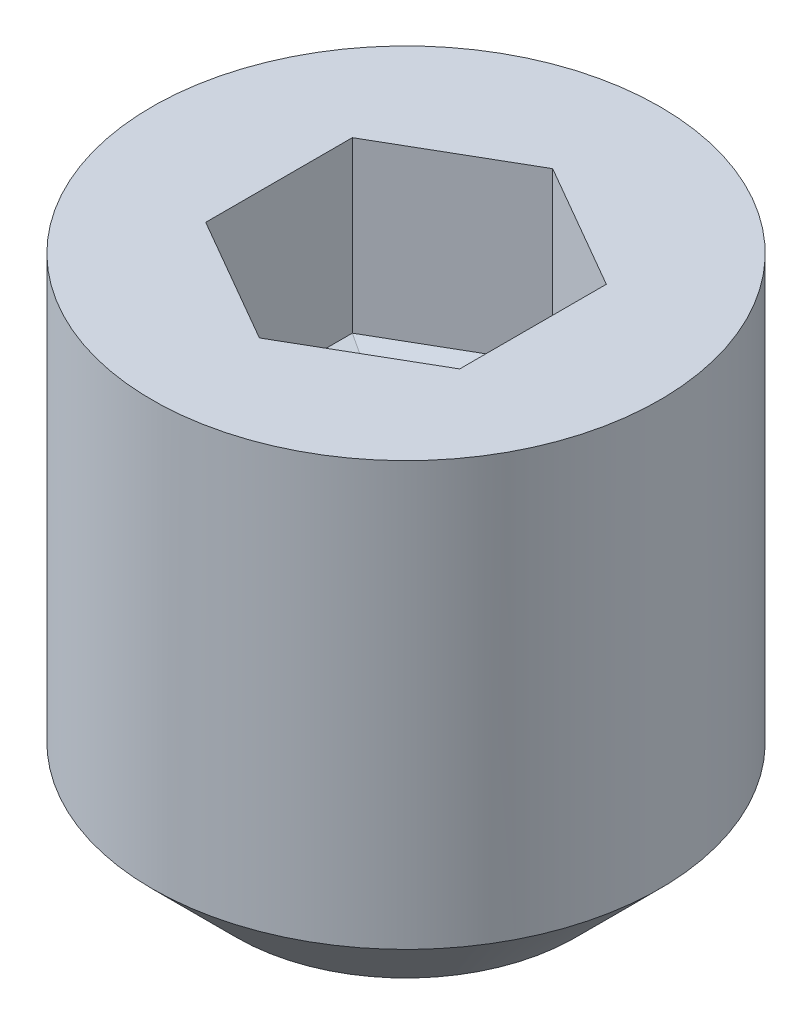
ISO-10303-21;
HEADER;
FILE_DESCRIPTION(('STEP AP214'),'2;1');
FILE_NAME('part.step','',(''),(''),'','','');
FILE_SCHEMA(('AUTOMOTIVE_DESIGN { 1 0 10303 214 1 1 1 1 }'));
ENDSEC;
DATA;
#1=APPLICATION_CONTEXT('core data for automotive mechanical design processes');
#2=APPLICATION_PROTOCOL_DEFINITION('international standard','automotive_design',2000,#1);
#3=PRODUCT_CONTEXT('',#1,'mechanical');
#4=PRODUCT('Part','Part','',(#3));
#5=PRODUCT_RELATED_PRODUCT_CATEGORY('part','',(#4));
#6=PRODUCT_DEFINITION_FORMATION('','',#4);
#7=PRODUCT_DEFINITION_CONTEXT('part definition',#1,'design');
#8=PRODUCT_DEFINITION('design','',#6,#7);
#9=PRODUCT_DEFINITION_SHAPE('','',#8);
#10=(LENGTH_UNIT() NAMED_UNIT(*) SI_UNIT(.MILLI.,.METRE.));
#11=(NAMED_UNIT(*) PLANE_ANGLE_UNIT() SI_UNIT($,.RADIAN.));
#12=(NAMED_UNIT(*) SI_UNIT($,.STERADIAN.) SOLID_ANGLE_UNIT());
#13=UNCERTAINTY_MEASURE_WITH_UNIT(LENGTH_MEASURE(1.E-05),#10,'distance_accuracy_value','');
#14=(GEOMETRIC_REPRESENTATION_CONTEXT(3) GLOBAL_UNCERTAINTY_ASSIGNED_CONTEXT((#13)) GLOBAL_UNIT_ASSIGNED_CONTEXT((#10,
#11,#12)) REPRESENTATION_CONTEXT('',''));
#15=CARTESIAN_POINT('',(0.,0.,0.));
#16=DIRECTION('',(0.,0.,1.));
#17=DIRECTION('',(1.,0.,0.));
#18=AXIS2_PLACEMENT_3D('',#15,#16,#17);
#19=CARTESIAN_POINT('',(0.750000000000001,-2.16666666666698,0.));
#20=DIRECTION('',(0.216930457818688,-0.976187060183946,0.));
#21=DIRECTION('',(0.976187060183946,0.216930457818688,0.));
#22=AXIS2_PLACEMENT_3D('',#19,#20,#21);
#23=PLANE('',#22);
#24=DIRECTION('',(0.850420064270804,0.188982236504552,0.490990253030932));
#25=VECTOR('',#24,1.);
#26=CARTESIAN_POINT('',(0.,-2.33333333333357,0.));
#27=LINE('',#26,#25);
#28=CARTESIAN_POINT('',(0.,-2.33333333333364,1.12098341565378E-13));
#29=VERTEX_POINT('',#28);
#30=CARTESIAN_POINT('',(1.50000000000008,-2.00000000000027,0.866025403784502));
#31=VERTEX_POINT('',#30);
#32=EDGE_CURVE('E97',#29,#31,#27,.T.);
#33=ORIENTED_EDGE('',*,*,#32,.T.);
#34=DIRECTION('',(0.,0.,1.));
#35=VECTOR('',#34,1.);
#36=CARTESIAN_POINT('',(1.50000000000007,-2.00000000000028,0.));
#37=LINE('',#36,#35);
#38=CARTESIAN_POINT('',(1.50000000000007,-2.00000000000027,-0.866025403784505));
#39=VERTEX_POINT('',#38);
#40=EDGE_CURVE('E69',#39,#31,#37,.T.);
#41=ORIENTED_EDGE('',*,*,#40,.F.);
#42=DIRECTION('',(-0.850420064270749,-0.188982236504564,0.490990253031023));
#43=VECTOR('',#42,1.);
#44=CARTESIAN_POINT('',(1.50000000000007,-2.00000000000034,-0.866025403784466));
#45=LINE('',#44,#43);
#46=EDGE_CURVE('E86',#39,#29,#45,.T.);
#47=ORIENTED_EDGE('',*,*,#46,.T.);
#48=EDGE_LOOP('',(#33,#41,#47));
#49=FACE_BOUND('',#48,.T.);
#50=ADVANCED_FACE('F16',(#49),#23,.F.);
#51=CARTESIAN_POINT('',(0.374999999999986,-2.16666666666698,-0.649519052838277));
#52=DIRECTION('',(0.108465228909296,-0.976187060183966,-0.187867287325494));
#53=DIRECTION('',(0.,0.188982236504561,-0.981980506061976));
#54=AXIS2_PLACEMENT_3D('',#51,#52,#53);
#55=PLANE('',#54);
#56=ORIENTED_EDGE('',*,*,#46,.F.);
#57=DIRECTION('',(0.866025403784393,0.,0.500000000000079));
#58=VECTOR('',#57,1.);
#59=CARTESIAN_POINT('',(0.,-2.0000000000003,-1.73205080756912));
#60=LINE('',#59,#58);
#61=CARTESIAN_POINT('',(0.,-2.00000000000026,-1.73205080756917));
#62=VERTEX_POINT('',#61);
#63=EDGE_CURVE('E75',#62,#39,#60,.T.);
#64=ORIENTED_EDGE('',*,*,#63,.F.);
#65=DIRECTION('',(0.,0.188982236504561,-0.981980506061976));
#66=VECTOR('',#65,1.);
#67=CARTESIAN_POINT('',(0.,-2.20684523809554,-0.657251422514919));
#68=LINE('',#67,#66);
#69=EDGE_CURVE('E101',#62,#29,#68,.F.);
#70=ORIENTED_EDGE('',*,*,#69,.T.);
#71=EDGE_LOOP('',(#56,#64,#70));
#72=FACE_BOUND('',#71,.T.);
#73=ADVANCED_FACE('F100',(#72),#55,.F.);
#74=CARTESIAN_POINT('',(0.374999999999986,-2.16666666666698,0.649519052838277));
#75=DIRECTION('',(0.108465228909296,-0.976187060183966,0.187867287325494));
#76=DIRECTION('',(0.,-0.188982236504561,-0.981980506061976));
#77=AXIS2_PLACEMENT_3D('',#74,#75,#76);
#78=PLANE('',#77);
#79=DIRECTION('',(0.,-0.188982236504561,-0.981980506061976));
#80=VECTOR('',#79,1.);
#81=CARTESIAN_POINT('',(0.,-2.20684523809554,0.657251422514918));
#82=LINE('',#81,#80);
#83=CARTESIAN_POINT('',(0.,-2.00000000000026,1.73205080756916));
#84=VERTEX_POINT('',#83);
#85=EDGE_CURVE('E142',#29,#84,#82,.F.);
#86=ORIENTED_EDGE('',*,*,#85,.T.);
#87=DIRECTION('',(-0.866025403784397,0.,0.500000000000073));
#88=VECTOR('',#87,1.);
#89=CARTESIAN_POINT('',(1.50000000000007,-2.00000000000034,0.866025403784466));
#90=LINE('',#89,#88);
#91=EDGE_CURVE('E102',#31,#84,#90,.T.);
#92=ORIENTED_EDGE('',*,*,#91,.F.);
#93=ORIENTED_EDGE('',*,*,#32,.F.);
#94=EDGE_LOOP('',(#86,#92,#93));
#95=FACE_BOUND('',#94,.T.);
#96=ADVANCED_FACE('F172',(#95),#78,.F.);
#97=CARTESIAN_POINT('',(-0.374999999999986,-2.16666666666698,-0.649519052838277));
#98=DIRECTION('',(-0.108465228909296,-0.976187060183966,-0.187867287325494));
#99=DIRECTION('',(0.,0.188982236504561,-0.981980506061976));
#100=AXIS2_PLACEMENT_3D('',#97,#98,#99);
#101=PLANE('',#100);
#102=ORIENTED_EDGE('',*,*,#69,.F.);
#103=DIRECTION('',(0.866025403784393,0.,-0.500000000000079));
#104=VECTOR('',#103,1.);
#105=CARTESIAN_POINT('',(-1.50000000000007,-2.00000000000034,-0.866025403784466));
#106=LINE('',#105,#104);
#107=CARTESIAN_POINT('',(-1.50000000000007,-2.0000000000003,-0.866025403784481));
#108=VERTEX_POINT('',#107);
#109=EDGE_CURVE('E148',#108,#62,#106,.T.);
#110=ORIENTED_EDGE('',*,*,#109,.F.);
#111=DIRECTION('',(0.850420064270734,-0.188982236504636,0.490990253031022));
#112=VECTOR('',#111,1.);
#113=CARTESIAN_POINT('',(-1.50000000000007,-2.00000000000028,-0.866025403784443));
#114=LINE('',#113,#112);
#115=EDGE_CURVE('E139',#108,#29,#114,.T.);
#116=ORIENTED_EDGE('',*,*,#115,.T.);
#117=EDGE_LOOP('',(#102,#110,#116));
#118=FACE_BOUND('',#117,.T.);
#119=ADVANCED_FACE('F155',(#118),#101,.F.);
#120=CARTESIAN_POINT('',(-0.374999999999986,-2.16666666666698,0.649519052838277));
#121=DIRECTION('',(-0.108465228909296,-0.976187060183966,0.187867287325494));
#122=DIRECTION('',(0.,-0.188982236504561,-0.981980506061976));
#123=AXIS2_PLACEMENT_3D('',#120,#121,#122);
#124=PLANE('',#123);
#125=DIRECTION('',(-0.850420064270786,0.188982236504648,0.490990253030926));
#126=VECTOR('',#125,1.);
#127=CARTESIAN_POINT('',(0.,-2.33333333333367,1.11022302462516E-13));
#128=LINE('',#127,#126);
#129=CARTESIAN_POINT('',(-1.50000000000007,-2.0000000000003,0.866025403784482));
#130=VERTEX_POINT('',#129);
#131=EDGE_CURVE('E136',#29,#130,#128,.T.);
#132=ORIENTED_EDGE('',*,*,#131,.T.);
#133=DIRECTION('',(-0.866025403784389,0.,-0.500000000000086));
#134=VECTOR('',#133,1.);
#135=CARTESIAN_POINT('',(0.,-2.0000000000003,1.73205080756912));
#136=LINE('',#135,#134);
#137=EDGE_CURVE('E145',#84,#130,#136,.T.);
#138=ORIENTED_EDGE('',*,*,#137,.F.);
#139=ORIENTED_EDGE('',*,*,#85,.F.);
#140=EDGE_LOOP('',(#132,#138,#139));
#141=FACE_BOUND('',#140,.T.);
#142=ADVANCED_FACE('F170',(#141),#124,.F.);
#143=CARTESIAN_POINT('',(-0.750000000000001,-2.16666666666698,0.));
#144=DIRECTION('',(-0.216930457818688,-0.976187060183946,0.));
#145=DIRECTION('',(0.976187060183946,-0.216930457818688,0.));
#146=AXIS2_PLACEMENT_3D('',#143,#144,#145);
#147=PLANE('',#146);
#148=ORIENTED_EDGE('',*,*,#115,.F.);
#149=DIRECTION('',(0.,0.,1.));
#150=VECTOR('',#149,1.);
#151=CARTESIAN_POINT('',(-1.5,-2.00000000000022,0.));
#152=LINE('',#151,#150);
#153=EDGE_CURVE('E131',#108,#130,#152,.T.);
#154=ORIENTED_EDGE('',*,*,#153,.T.);
#155=ORIENTED_EDGE('',*,*,#131,.F.);
#156=EDGE_LOOP('',(#148,#154,#155));
#157=FACE_BOUND('',#156,.T.);
#158=ADVANCED_FACE('F160',(#157),#147,.F.);
#159=CARTESIAN_POINT('',(-1.5,-1.,0.));
#160=DIRECTION('',(-1.,0.,0.));
#161=DIRECTION('',(0.,0.,1.));
#162=AXIS2_PLACEMENT_3D('',#159,#160,#161);
#163=PLANE('',#162);
#164=DIRECTION('',(0.,1.,0.));
#165=VECTOR('',#164,1.);
#166=CARTESIAN_POINT('',(-1.50000000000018,-1.,-0.866025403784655));
#167=LINE('',#166,#165);
#168=CARTESIAN_POINT('',(-1.50000000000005,0.,-0.866025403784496));
#169=VERTEX_POINT('',#168);
#170=EDGE_CURVE('E128',#108,#169,#167,.T.);
#171=ORIENTED_EDGE('',*,*,#170,.T.);
#172=DIRECTION('',(0.,0.,1.));
#173=VECTOR('',#172,1.);
#174=CARTESIAN_POINT('',(-1.5,0.,0.));
#175=LINE('',#174,#173);
#176=CARTESIAN_POINT('',(-1.50000000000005,0.,0.866025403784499));
#177=VERTEX_POINT('',#176);
#178=EDGE_CURVE('E134',#177,#169,#175,.F.);
#179=ORIENTED_EDGE('',*,*,#178,.F.);
#180=DIRECTION('',(0.,1.,0.));
#181=VECTOR('',#180,1.);
#182=CARTESIAN_POINT('',(-1.50000000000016,-1.,0.866025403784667));
#183=LINE('',#182,#181);
#184=EDGE_CURVE('E121',#177,#130,#183,.F.);
#185=ORIENTED_EDGE('',*,*,#184,.T.);
#186=ORIENTED_EDGE('',*,*,#153,.F.);
#187=EDGE_LOOP('',(#171,#179,#185,#186));
#188=FACE_BOUND('',#187,.T.);
#189=ADVANCED_FACE('F162',(#188),#163,.F.);
#190=CARTESIAN_POINT('',(-0.750000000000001,-1.,-1.299038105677));
#191=DIRECTION('',(-0.500000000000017,0.,-0.866025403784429));
#192=DIRECTION('',(-0.866025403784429,0.,0.500000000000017));
#193=AXIS2_PLACEMENT_3D('',#190,#191,#192);
#194=PLANE('',#193);
#195=DIRECTION('',(0.,1.,0.));
#196=VECTOR('',#195,1.);
#197=CARTESIAN_POINT('',(0.,-1.,-1.7320508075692));
#198=LINE('',#197,#196);
#199=CARTESIAN_POINT('',(0.,0.,-1.73205080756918));
#200=VERTEX_POINT('',#199);
#201=EDGE_CURVE('E81',#62,#200,#198,.T.);
#202=ORIENTED_EDGE('',*,*,#201,.T.);
#203=DIRECTION('',(-0.866025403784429,0.,0.500000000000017));
#204=VECTOR('',#203,1.);
#205=CARTESIAN_POINT('',(-0.750000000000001,0.,-1.299038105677));
#206=LINE('',#205,#204);
#207=EDGE_CURVE('E126',#169,#200,#206,.F.);
#208=ORIENTED_EDGE('',*,*,#207,.F.);
#209=ORIENTED_EDGE('',*,*,#170,.F.);
#210=ORIENTED_EDGE('',*,*,#109,.T.);
#211=EDGE_LOOP('',(#202,#208,#209,#210));
#212=FACE_BOUND('',#211,.T.);
#213=ADVANCED_FACE('F151',(#212),#194,.F.);
#214=CARTESIAN_POINT('',(-0.750000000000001,-1.,1.299038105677));
#215=DIRECTION('',(-0.500000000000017,0.,0.866025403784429));
#216=DIRECTION('',(0.866025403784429,0.,0.500000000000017));
#217=AXIS2_PLACEMENT_3D('',#214,#215,#216);
#218=PLANE('',#217);
#219=ORIENTED_EDGE('',*,*,#184,.F.);
#220=DIRECTION('',(0.866025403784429,0.,0.500000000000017));
#221=VECTOR('',#220,1.);
#222=CARTESIAN_POINT('',(-0.750000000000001,0.,1.299038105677));
#223=LINE('',#222,#221);
#224=CARTESIAN_POINT('',(0.,0.,1.73205080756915));
#225=VERTEX_POINT('',#224);
#226=EDGE_CURVE('E124',#225,#177,#223,.F.);
#227=ORIENTED_EDGE('',*,*,#226,.F.);
#228=DIRECTION('',(0.,1.,0.));
#229=VECTOR('',#228,1.);
#230=CARTESIAN_POINT('',(0.,-1.,1.7320508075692));
#231=LINE('',#230,#229);
#232=EDGE_CURVE('E92',#225,#84,#231,.F.);
#233=ORIENTED_EDGE('',*,*,#232,.T.);
#234=ORIENTED_EDGE('',*,*,#137,.T.);
#235=EDGE_LOOP('',(#219,#227,#233,#234));
#236=FACE_BOUND('',#235,.T.);
#237=ADVANCED_FACE('F167',(#236),#218,.F.);
#238=CARTESIAN_POINT('',(0.750000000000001,-1.,-1.299038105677));
#239=DIRECTION('',(0.500000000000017,0.,-0.866025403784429));
#240=DIRECTION('',(-0.866025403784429,0.,-0.500000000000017));
#241=AXIS2_PLACEMENT_3D('',#238,#239,#240);
#242=PLANE('',#241);
#243=DIRECTION('',(0.,1.,0.));
#244=VECTOR('',#243,1.);
#245=CARTESIAN_POINT('',(1.5,-1.,-0.866025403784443));
#246=LINE('',#245,#244);
#247=CARTESIAN_POINT('',(1.50000000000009,0.,-0.866025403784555));
#248=VERTEX_POINT('',#247);
#249=EDGE_CURVE('E78',#39,#248,#246,.T.);
#250=ORIENTED_EDGE('',*,*,#249,.T.);
#251=DIRECTION('',(-0.866025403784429,0.,-0.500000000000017));
#252=VECTOR('',#251,1.);
#253=CARTESIAN_POINT('',(0.750000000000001,0.,-1.299038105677));
#254=LINE('',#253,#252);
#255=EDGE_CURVE('E118',#200,#248,#254,.F.);
#256=ORIENTED_EDGE('',*,*,#255,.F.);
#257=ORIENTED_EDGE('',*,*,#201,.F.);
#258=ORIENTED_EDGE('',*,*,#63,.T.);
#259=EDGE_LOOP('',(#250,#256,#257,#258));
#260=FACE_BOUND('',#259,.T.);
#261=ADVANCED_FACE('F76',(#260),#242,.F.);
#262=CARTESIAN_POINT('',(0.750000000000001,-1.,1.299038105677));
#263=DIRECTION('',(0.500000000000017,0.,0.866025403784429));
#264=DIRECTION('',(0.866025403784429,0.,-0.500000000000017));
#265=AXIS2_PLACEMENT_3D('',#262,#263,#264);
#266=PLANE('',#265);
#267=ORIENTED_EDGE('',*,*,#232,.F.);
#268=DIRECTION('',(0.866025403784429,0.,-0.500000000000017));
#269=VECTOR('',#268,1.);
#270=CARTESIAN_POINT('',(0.750000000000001,0.,1.299038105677));
#271=LINE('',#270,#269);
#272=CARTESIAN_POINT('',(1.5000000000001,0.,0.866025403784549));
#273=VERTEX_POINT('',#272);
#274=EDGE_CURVE('E34',#273,#225,#271,.F.);
#275=ORIENTED_EDGE('',*,*,#274,.F.);
#276=DIRECTION('',(0.,1.,0.));
#277=VECTOR('',#276,1.);
#278=CARTESIAN_POINT('',(1.5,-1.,0.866025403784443));
#279=LINE('',#278,#277);
#280=EDGE_CURVE('E91',#273,#31,#279,.F.);
#281=ORIENTED_EDGE('',*,*,#280,.T.);
#282=ORIENTED_EDGE('',*,*,#91,.T.);
#283=EDGE_LOOP('',(#267,#275,#281,#282));
#284=FACE_BOUND('',#283,.T.);
#285=ADVANCED_FACE('F173',(#284),#266,.F.);
#286=CARTESIAN_POINT('',(1.5,-1.,0.));
#287=DIRECTION('',(1.,0.,0.));
#288=DIRECTION('',(0.,0.,-1.));
#289=AXIS2_PLACEMENT_3D('',#286,#287,#288);
#290=PLANE('',#289);
#291=ORIENTED_EDGE('',*,*,#280,.F.);
#292=DIRECTION('',(0.,0.,-1.));
#293=VECTOR('',#292,1.);
#294=CARTESIAN_POINT('',(1.50000000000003,0.,0.));
#295=LINE('',#294,#293);
#296=EDGE_CURVE('E90',#273,#248,#295,.T.);
#297=ORIENTED_EDGE('',*,*,#296,.T.);
#298=ORIENTED_EDGE('',*,*,#249,.F.);
#299=ORIENTED_EDGE('',*,*,#40,.T.);
#300=EDGE_LOOP('',(#291,#297,#298,#299));
#301=FACE_BOUND('',#300,.T.);
#302=ADVANCED_FACE('F88',(#301),#290,.F.);
#303=CARTESIAN_POINT('',(0.,-6.00000000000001,0.));
#304=DIRECTION('',(0.,-1.,0.));
#305=DIRECTION('',(0.,0.,-1.));
#306=AXIS2_PLACEMENT_3D('',#303,#304,#305);
#307=PLANE('',#306);
#308=CARTESIAN_POINT('',(0.,-5.99999999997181,0.));
#309=DIRECTION('',(0.,1.,0.));
#310=DIRECTION('',(0.,0.,1.));
#311=AXIS2_PLACEMENT_3D('',#308,#309,#310);
#312=CIRCLE('',#311,1.99999999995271);
#313=CARTESIAN_POINT('',(0.,-5.99999999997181,1.99999999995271));
#314=VERTEX_POINT('',#313);
#315=EDGE_CURVE('E19',#314,#314,#312,.T.);
#316=ORIENTED_EDGE('',*,*,#315,.F.);
#317=EDGE_LOOP('',(#316));
#318=FACE_BOUND('',#317,.T.);
#319=ADVANCED_FACE('F178',(#318),#307,.T.);
#320=CARTESIAN_POINT('',(0.,0.,0.));
#321=DIRECTION('',(0.,-1.,0.));
#322=DIRECTION('',(0.,0.,-1.));
#323=AXIS2_PLACEMENT_3D('',#320,#321,#322);
#324=PLANE('',#323);
#325=CARTESIAN_POINT('',(0.,0.,0.));
#326=DIRECTION('',(0.,-1.,0.));
#327=DIRECTION('',(0.,0.,-1.));
#328=AXIS2_PLACEMENT_3D('',#325,#326,#327);
#329=CIRCLE('',#328,3.);
#330=CARTESIAN_POINT('',(0.,0.,-3.));
#331=VERTEX_POINT('',#330);
#332=EDGE_CURVE('E25',#331,#331,#329,.T.);
#333=ORIENTED_EDGE('',*,*,#332,.F.);
#334=EDGE_LOOP('',(#333));
#335=FACE_BOUND('',#334,.T.);
#336=ORIENTED_EDGE('',*,*,#274,.T.);
#337=ORIENTED_EDGE('',*,*,#226,.T.);
#338=ORIENTED_EDGE('',*,*,#178,.T.);
#339=ORIENTED_EDGE('',*,*,#207,.T.);
#340=ORIENTED_EDGE('',*,*,#255,.T.);
#341=ORIENTED_EDGE('',*,*,#296,.F.);
#342=EDGE_LOOP('',(#336,#337,#338,#339,#340,#341));
#343=FACE_BOUND('',#342,.T.);
#344=ADVANCED_FACE('F175',(#335,#343),#324,.F.);
#345=CARTESIAN_POINT('',(0.,-4.99999999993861,0.));
#346=DIRECTION('',(0.,1.,0.));
#347=DIRECTION('',(0.,0.,1.));
#348=AXIS2_PLACEMENT_3D('',#345,#346,#347);
#349=CONICAL_SURFACE('',#348,2.9999999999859,0.785398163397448);
#350=CARTESIAN_POINT('',(0.,-5.,0.));
#351=DIRECTION('',(0.,-1.,0.));
#352=DIRECTION('',(0.,0.,-1.));
#353=AXIS2_PLACEMENT_3D('',#350,#351,#352);
#354=CIRCLE('',#353,3.);
#355=CARTESIAN_POINT('',(0.,-5.,-3.));
#356=VERTEX_POINT('',#355);
#357=EDGE_CURVE('E11',#356,#356,#354,.F.);
#358=ORIENTED_EDGE('',*,*,#357,.F.);
#359=EDGE_LOOP('',(#358));
#360=FACE_BOUND('',#359,.T.);
#361=ORIENTED_EDGE('',*,*,#315,.T.);
#362=EDGE_LOOP('',(#361));
#363=FACE_BOUND('',#362,.T.);
#364=ADVANCED_FACE('F177',(#360,#363),#349,.T.);
#365=CARTESIAN_POINT('',(0.,0.299999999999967,0.));
#366=DIRECTION('',(0.,-1.,0.));
#367=DIRECTION('',(0.,0.,-1.));
#368=AXIS2_PLACEMENT_3D('',#365,#366,#367);
#369=CYLINDRICAL_SURFACE('',#368,3.);
#370=ORIENTED_EDGE('',*,*,#357,.T.);
#371=EDGE_LOOP('',(#370));
#372=FACE_BOUND('',#371,.T.);
#373=ORIENTED_EDGE('',*,*,#332,.T.);
#374=EDGE_LOOP('',(#373));
#375=FACE_BOUND('',#374,.T.);
#376=ADVANCED_FACE('F186',(#372,#375),#369,.T.);
#377=CLOSED_SHELL('',(#50,#73,#96,#119,#142,#158,#189,#213,#237,#261,#285,#302,#319,#344,#364,#376));
#378=MANIFOLD_SOLID_BREP('B1',#377);
#379=ADVANCED_BREP_SHAPE_REPRESENTATION('',(#18,#378),#14);
#380=SHAPE_DEFINITION_REPRESENTATION(#9,#379);
ENDSEC;
END-ISO-10303-21;
